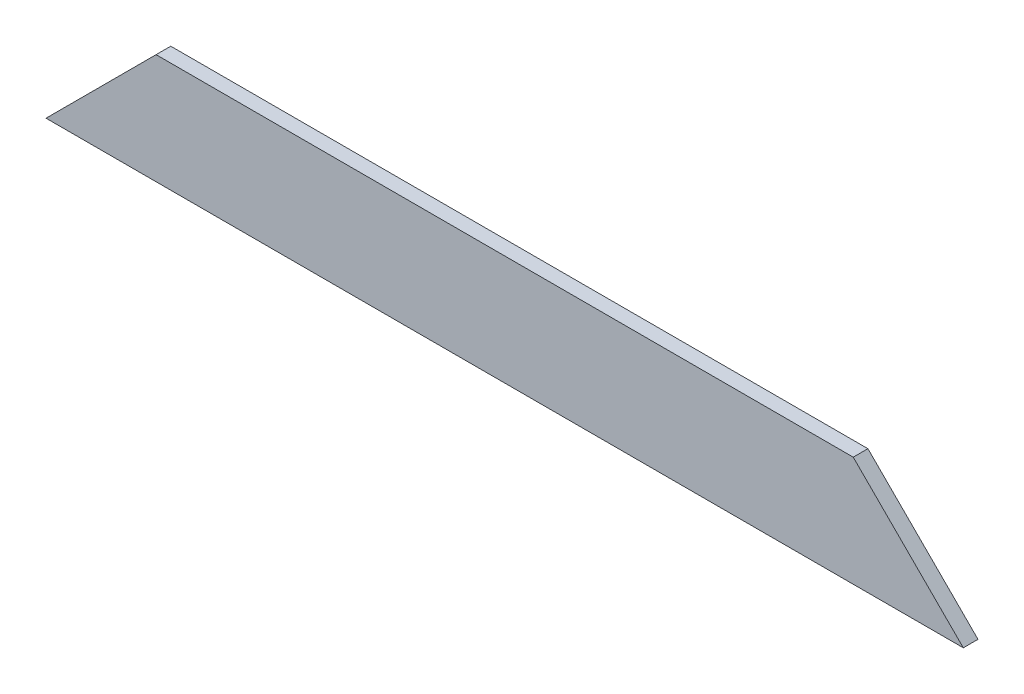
ISO-10303-21;
HEADER;
FILE_DESCRIPTION(('STEP AP214'),'2;1');
FILE_NAME('part.step','',(''),(''),'','','');
FILE_SCHEMA(('AUTOMOTIVE_DESIGN { 1 0 10303 214 1 1 1 1 }'));
ENDSEC;
DATA;
#1=APPLICATION_CONTEXT('core data for automotive mechanical design processes');
#2=APPLICATION_PROTOCOL_DEFINITION('international standard','automotive_design',2000,#1);
#3=PRODUCT_CONTEXT('',#1,'mechanical');
#4=PRODUCT('Part','Part','',(#3));
#5=PRODUCT_RELATED_PRODUCT_CATEGORY('part','',(#4));
#6=PRODUCT_DEFINITION_FORMATION('','',#4);
#7=PRODUCT_DEFINITION_CONTEXT('part definition',#1,'design');
#8=PRODUCT_DEFINITION('design','',#6,#7);
#9=PRODUCT_DEFINITION_SHAPE('','',#8);
#10=(LENGTH_UNIT() NAMED_UNIT(*) SI_UNIT(.MILLI.,.METRE.));
#11=(NAMED_UNIT(*) PLANE_ANGLE_UNIT() SI_UNIT($,.RADIAN.));
#12=(NAMED_UNIT(*) SI_UNIT($,.STERADIAN.) SOLID_ANGLE_UNIT());
#13=UNCERTAINTY_MEASURE_WITH_UNIT(LENGTH_MEASURE(1.E-05),#10,'distance_accuracy_value','');
#14=(GEOMETRIC_REPRESENTATION_CONTEXT(3) GLOBAL_UNCERTAINTY_ASSIGNED_CONTEXT((#13)) GLOBAL_UNIT_ASSIGNED_CONTEXT((#10,
#11,#12)) REPRESENTATION_CONTEXT('',''));
#15=CARTESIAN_POINT('',(0.,0.,0.));
#16=DIRECTION('',(0.,0.,1.));
#17=DIRECTION('',(1.,0.,0.));
#18=AXIS2_PLACEMENT_3D('',#15,#16,#17);
#19=CARTESIAN_POINT('',(0.,0.,8.));
#20=DIRECTION('',(0.,1.,0.));
#21=DIRECTION('',(0.,0.,1.));
#22=AXIS2_PLACEMENT_3D('',#19,#20,#21);
#23=PLANE('',#22);
#24=DIRECTION('',(1.,0.,0.));
#25=VECTOR('',#24,1.);
#26=CARTESIAN_POINT('',(0.,0.,0.));
#27=LINE('',#26,#25);
#28=CARTESIAN_POINT('',(0.,0.,0.));
#29=VERTEX_POINT('',#28);
#30=CARTESIAN_POINT('',(500.,0.,0.));
#31=VERTEX_POINT('',#30);
#32=EDGE_CURVE('E73',#29,#31,#27,.T.);
#33=ORIENTED_EDGE('',*,*,#32,.T.);
#34=DIRECTION('',(0.,0.,-1.));
#35=VECTOR('',#34,1.);
#36=CARTESIAN_POINT('',(500.,0.,8.));
#37=LINE('',#36,#35);
#38=CARTESIAN_POINT('',(500.,0.,8.));
#39=VERTEX_POINT('',#38);
#40=EDGE_CURVE('E11',#39,#31,#37,.T.);
#41=ORIENTED_EDGE('',*,*,#40,.F.);
#42=DIRECTION('',(1.,0.,0.));
#43=VECTOR('',#42,1.);
#44=CARTESIAN_POINT('',(0.,0.,8.));
#45=LINE('',#44,#43);
#46=CARTESIAN_POINT('',(0.,0.,8.));
#47=VERTEX_POINT('',#46);
#48=EDGE_CURVE('E91',#47,#39,#45,.T.);
#49=ORIENTED_EDGE('',*,*,#48,.F.);
#50=DIRECTION('',(0.,0.,-1.));
#51=VECTOR('',#50,1.);
#52=CARTESIAN_POINT('',(0.,0.,8.));
#53=LINE('',#52,#51);
#54=EDGE_CURVE('E85',#47,#29,#53,.T.);
#55=ORIENTED_EDGE('',*,*,#54,.T.);
#56=EDGE_LOOP('',(#33,#41,#49,#55));
#57=FACE_BOUND('',#56,.T.);
#58=ADVANCED_FACE('F29',(#57),#23,.F.);
#59=CARTESIAN_POINT('',(440.,60.,8.));
#60=DIRECTION('',(-0.707106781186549,-0.707106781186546,0.));
#61=DIRECTION('',(0.707106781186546,-0.707106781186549,0.));
#62=AXIS2_PLACEMENT_3D('',#59,#60,#61);
#63=PLANE('',#62);
#64=DIRECTION('',(-0.707106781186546,0.707106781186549,0.));
#65=VECTOR('',#64,1.);
#66=CARTESIAN_POINT('',(440.,60.,0.));
#67=LINE('',#66,#65);
#68=CARTESIAN_POINT('',(440.,60.,0.));
#69=VERTEX_POINT('',#68);
#70=EDGE_CURVE('E69',#31,#69,#67,.T.);
#71=ORIENTED_EDGE('',*,*,#70,.T.);
#72=DIRECTION('',(0.,0.,-1.));
#73=VECTOR('',#72,1.);
#74=CARTESIAN_POINT('',(440.,60.,8.));
#75=LINE('',#74,#73);
#76=CARTESIAN_POINT('',(440.,60.,8.));
#77=VERTEX_POINT('',#76);
#78=EDGE_CURVE('E36',#77,#69,#75,.T.);
#79=ORIENTED_EDGE('',*,*,#78,.F.);
#80=DIRECTION('',(-0.707106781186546,0.707106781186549,0.));
#81=VECTOR('',#80,1.);
#82=CARTESIAN_POINT('',(440.,60.,8.));
#83=LINE('',#82,#81);
#84=EDGE_CURVE('E81',#39,#77,#83,.T.);
#85=ORIENTED_EDGE('',*,*,#84,.F.);
#86=ORIENTED_EDGE('',*,*,#40,.T.);
#87=EDGE_LOOP('',(#71,#79,#85,#86));
#88=FACE_BOUND('',#87,.T.);
#89=ADVANCED_FACE('F80',(#88),#63,.F.);
#90=CARTESIAN_POINT('',(59.9999999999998,60.,8.));
#91=DIRECTION('',(0.,-1.,0.));
#92=DIRECTION('',(0.,0.,-1.));
#93=AXIS2_PLACEMENT_3D('',#90,#91,#92);
#94=PLANE('',#93);
#95=DIRECTION('',(-1.,0.,0.));
#96=VECTOR('',#95,1.);
#97=CARTESIAN_POINT('',(59.9999999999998,60.,0.));
#98=LINE('',#97,#96);
#99=CARTESIAN_POINT('',(59.9999999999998,60.,0.));
#100=VERTEX_POINT('',#99);
#101=EDGE_CURVE('E74',#69,#100,#98,.T.);
#102=ORIENTED_EDGE('',*,*,#101,.T.);
#103=DIRECTION('',(0.,0.,-1.));
#104=VECTOR('',#103,1.);
#105=CARTESIAN_POINT('',(59.9999999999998,60.,8.));
#106=LINE('',#105,#104);
#107=CARTESIAN_POINT('',(59.9999999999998,60.,8.));
#108=VERTEX_POINT('',#107);
#109=EDGE_CURVE('E97',#108,#100,#106,.T.);
#110=ORIENTED_EDGE('',*,*,#109,.F.);
#111=DIRECTION('',(-1.,0.,0.));
#112=VECTOR('',#111,1.);
#113=CARTESIAN_POINT('',(59.9999999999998,60.,8.));
#114=LINE('',#113,#112);
#115=EDGE_CURVE('E48',#77,#108,#114,.T.);
#116=ORIENTED_EDGE('',*,*,#115,.F.);
#117=ORIENTED_EDGE('',*,*,#78,.T.);
#118=EDGE_LOOP('',(#102,#110,#116,#117));
#119=FACE_BOUND('',#118,.T.);
#120=ADVANCED_FACE('F100',(#119),#94,.F.);
#121=CARTESIAN_POINT('',(0.,0.,8.));
#122=DIRECTION('',(0.707106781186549,-0.707106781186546,0.));
#123=DIRECTION('',(0.707106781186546,0.707106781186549,0.));
#124=AXIS2_PLACEMENT_3D('',#121,#122,#123);
#125=PLANE('',#124);
#126=DIRECTION('',(-0.707106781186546,-0.707106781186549,0.));
#127=VECTOR('',#126,1.);
#128=CARTESIAN_POINT('',(0.,0.,0.));
#129=LINE('',#128,#127);
#130=EDGE_CURVE('E89',#100,#29,#129,.T.);
#131=ORIENTED_EDGE('',*,*,#130,.T.);
#132=ORIENTED_EDGE('',*,*,#54,.F.);
#133=DIRECTION('',(-0.707106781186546,-0.707106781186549,0.));
#134=VECTOR('',#133,1.);
#135=CARTESIAN_POINT('',(0.,0.,8.));
#136=LINE('',#135,#134);
#137=EDGE_CURVE('E43',#108,#47,#136,.T.);
#138=ORIENTED_EDGE('',*,*,#137,.F.);
#139=ORIENTED_EDGE('',*,*,#109,.T.);
#140=EDGE_LOOP('',(#131,#132,#138,#139));
#141=FACE_BOUND('',#140,.T.);
#142=ADVANCED_FACE('F102',(#141),#125,.F.);
#143=CARTESIAN_POINT('',(0.,0.,8.));
#144=DIRECTION('',(0.,0.,1.));
#145=DIRECTION('',(1.,0.,0.));
#146=AXIS2_PLACEMENT_3D('',#143,#144,#145);
#147=PLANE('',#146);
#148=ORIENTED_EDGE('',*,*,#48,.T.);
#149=ORIENTED_EDGE('',*,*,#84,.T.);
#150=ORIENTED_EDGE('',*,*,#115,.T.);
#151=ORIENTED_EDGE('',*,*,#137,.T.);
#152=EDGE_LOOP('',(#148,#149,#150,#151));
#153=FACE_BOUND('',#152,.T.);
#154=ADVANCED_FACE('F103',(#153),#147,.T.);
#155=CARTESIAN_POINT('',(0.,0.,0.));
#156=DIRECTION('',(0.,0.,1.));
#157=DIRECTION('',(1.,0.,0.));
#158=AXIS2_PLACEMENT_3D('',#155,#156,#157);
#159=PLANE('',#158);
#160=ORIENTED_EDGE('',*,*,#32,.F.);
#161=ORIENTED_EDGE('',*,*,#130,.F.);
#162=ORIENTED_EDGE('',*,*,#101,.F.);
#163=ORIENTED_EDGE('',*,*,#70,.F.);
#164=EDGE_LOOP('',(#160,#161,#162,#163));
#165=FACE_BOUND('',#164,.T.);
#166=ADVANCED_FACE('F70',(#165),#159,.F.);
#167=CLOSED_SHELL('',(#58,#89,#120,#142,#154,#166));
#168=MANIFOLD_SOLID_BREP('B2',#167);
#169=ADVANCED_BREP_SHAPE_REPRESENTATION('',(#18,#168),#14);
#170=SHAPE_DEFINITION_REPRESENTATION(#9,#169);
ENDSEC;
END-ISO-10303-21;
